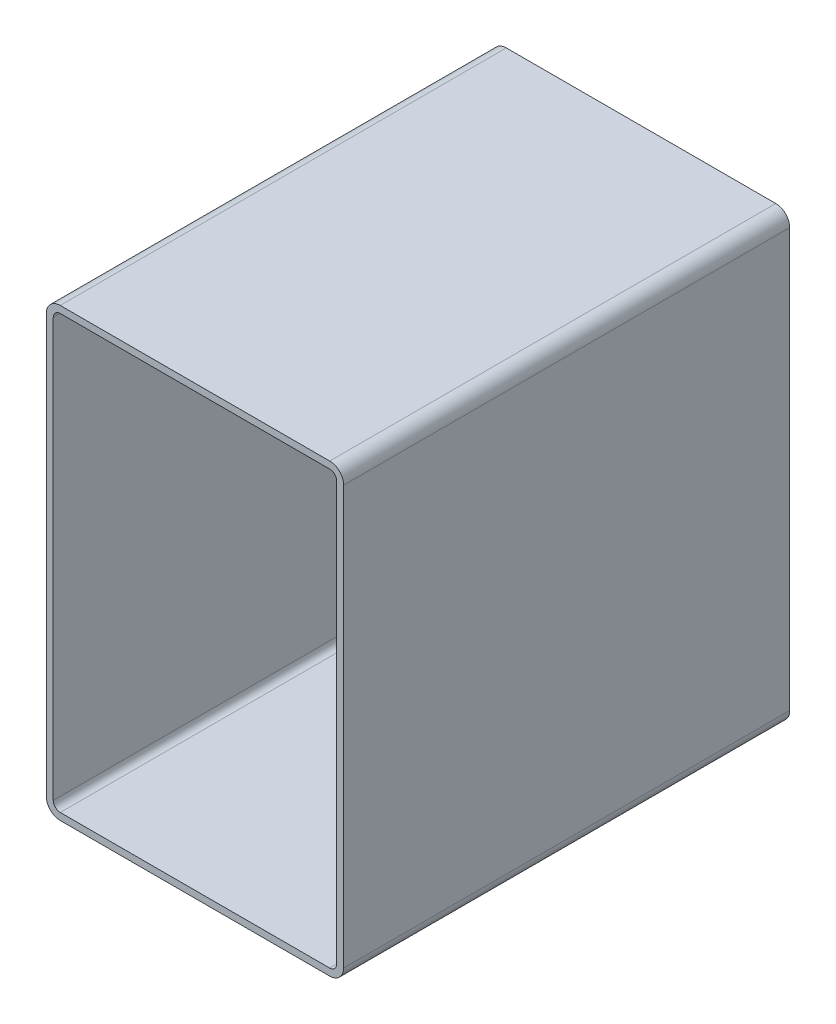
ISO-10303-21;
HEADER;
FILE_DESCRIPTION(('STEP AP214'),'2;1');
FILE_NAME('part.step','',(''),(''),'','','');
FILE_SCHEMA(('AUTOMOTIVE_DESIGN { 1 0 10303 214 1 1 1 1 }'));
ENDSEC;
DATA;
#1=APPLICATION_CONTEXT('core data for automotive mechanical design processes');
#2=APPLICATION_PROTOCOL_DEFINITION('international standard','automotive_design',2000,#1);
#3=PRODUCT_CONTEXT('',#1,'mechanical');
#4=PRODUCT('Part','Part','',(#3));
#5=PRODUCT_RELATED_PRODUCT_CATEGORY('part','',(#4));
#6=PRODUCT_DEFINITION_FORMATION('','',#4);
#7=PRODUCT_DEFINITION_CONTEXT('part definition',#1,'design');
#8=PRODUCT_DEFINITION('design','',#6,#7);
#9=PRODUCT_DEFINITION_SHAPE('','',#8);
#10=(LENGTH_UNIT() NAMED_UNIT(*) SI_UNIT(.MILLI.,.METRE.));
#11=(NAMED_UNIT(*) PLANE_ANGLE_UNIT() SI_UNIT($,.RADIAN.));
#12=(NAMED_UNIT(*) SI_UNIT($,.STERADIAN.) SOLID_ANGLE_UNIT());
#13=UNCERTAINTY_MEASURE_WITH_UNIT(LENGTH_MEASURE(1.E-05),#10,'distance_accuracy_value','');
#14=(GEOMETRIC_REPRESENTATION_CONTEXT(3) GLOBAL_UNCERTAINTY_ASSIGNED_CONTEXT((#13)) GLOBAL_UNIT_ASSIGNED_CONTEXT((#10,
#11,#12)) REPRESENTATION_CONTEXT('',''));
#15=CARTESIAN_POINT('',(0.,0.,0.));
#16=DIRECTION('',(0.,0.,1.));
#17=DIRECTION('',(1.,0.,0.));
#18=AXIS2_PLACEMENT_3D('',#15,#16,#17);
#19=CARTESIAN_POINT('',(10.9159404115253,297.149496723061,304.8));
#20=DIRECTION('',(0.,0.,1.));
#21=DIRECTION('',(1.,0.,0.));
#22=AXIS2_PLACEMENT_3D('',#19,#20,#21);
#23=PLANE('',#22);
#24=CARTESIAN_POINT('',(10.9159404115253,297.149496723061,304.8));
#25=DIRECTION('',(0.,0.,1.));
#26=DIRECTION('',(1.,0.,0.));
#27=AXIS2_PLACEMENT_3D('',#24,#25,#26);
#28=CIRCLE('',#27,9.52500000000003);
#29=CARTESIAN_POINT('',(10.9159404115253,306.674496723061,304.8));
#30=VERTEX_POINT('',#29);
#31=CARTESIAN_POINT('',(1.3909404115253,297.149496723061,304.8));
#32=VERTEX_POINT('',#31);
#33=EDGE_CURVE('E211',#30,#32,#28,.T.);
#34=ORIENTED_EDGE('',*,*,#33,.T.);
#35=DIRECTION('',(0.,-1.,0.));
#36=VECTOR('',#35,1.);
#37=CARTESIAN_POINT('',(1.3909404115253,11.3994967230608,304.8));
#38=LINE('',#37,#36);
#39=CARTESIAN_POINT('',(1.3909404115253,11.3994967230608,304.8));
#40=VERTEX_POINT('',#39);
#41=EDGE_CURVE('E214',#32,#40,#38,.T.);
#42=ORIENTED_EDGE('',*,*,#41,.T.);
#43=CARTESIAN_POINT('',(10.9159404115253,11.3994967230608,304.8));
#44=DIRECTION('',(0.,0.,1.));
#45=DIRECTION('',(1.,0.,0.));
#46=AXIS2_PLACEMENT_3D('',#43,#44,#45);
#47=CIRCLE('',#46,9.52499999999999);
#48=CARTESIAN_POINT('',(10.9159404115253,1.87449672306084,304.8));
#49=VERTEX_POINT('',#48);
#50=EDGE_CURVE('E217',#40,#49,#47,.T.);
#51=ORIENTED_EDGE('',*,*,#50,.T.);
#52=DIRECTION('',(1.,0.,0.));
#53=VECTOR('',#52,1.);
#54=CARTESIAN_POINT('',(195.065940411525,1.87449672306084,304.8));
#55=LINE('',#54,#53);
#56=CARTESIAN_POINT('',(195.065940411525,1.87449672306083,304.8));
#57=VERTEX_POINT('',#56);
#58=EDGE_CURVE('E219',#49,#57,#55,.T.);
#59=ORIENTED_EDGE('',*,*,#58,.T.);
#60=CARTESIAN_POINT('',(195.065940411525,11.3994967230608,304.8));
#61=DIRECTION('',(0.,0.,1.));
#62=DIRECTION('',(1.,0.,0.));
#63=AXIS2_PLACEMENT_3D('',#60,#61,#62);
#64=CIRCLE('',#63,9.525);
#65=CARTESIAN_POINT('',(204.590940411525,11.3994967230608,304.8));
#66=VERTEX_POINT('',#65);
#67=EDGE_CURVE('E221',#57,#66,#64,.T.);
#68=ORIENTED_EDGE('',*,*,#67,.T.);
#69=DIRECTION('',(0.,1.,0.));
#70=VECTOR('',#69,1.);
#71=CARTESIAN_POINT('',(204.590940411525,297.149496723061,304.8));
#72=LINE('',#71,#70);
#73=CARTESIAN_POINT('',(204.590940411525,297.149496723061,304.8));
#74=VERTEX_POINT('',#73);
#75=EDGE_CURVE('E223',#66,#74,#72,.T.);
#76=ORIENTED_EDGE('',*,*,#75,.T.);
#77=CARTESIAN_POINT('',(195.065940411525,297.149496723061,304.8));
#78=DIRECTION('',(0.,0.,1.));
#79=DIRECTION('',(1.,0.,0.));
#80=AXIS2_PLACEMENT_3D('',#77,#78,#79);
#81=CIRCLE('',#80,9.52500000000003);
#82=CARTESIAN_POINT('',(195.065940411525,306.674496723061,304.8));
#83=VERTEX_POINT('',#82);
#84=EDGE_CURVE('E225',#74,#83,#81,.T.);
#85=ORIENTED_EDGE('',*,*,#84,.T.);
#86=DIRECTION('',(-1.,0.,0.));
#87=VECTOR('',#86,1.);
#88=CARTESIAN_POINT('',(10.9159404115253,306.674496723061,304.8));
#89=LINE('',#88,#87);
#90=EDGE_CURVE('E227',#83,#30,#89,.T.);
#91=ORIENTED_EDGE('',*,*,#90,.T.);
#92=EDGE_LOOP('',(#34,#42,#51,#59,#68,#76,#85,#91));
#93=FACE_BOUND('',#92,.T.);
#94=DIRECTION('',(0.,-1.,0.));
#95=VECTOR('',#94,1.);
#96=CARTESIAN_POINT('',(6.1534404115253,11.3994967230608,304.8));
#97=LINE('',#96,#95);
#98=CARTESIAN_POINT('',(6.1534404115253,297.149496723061,304.8));
#99=VERTEX_POINT('',#98);
#100=CARTESIAN_POINT('',(6.1534404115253,11.3994967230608,304.8));
#101=VERTEX_POINT('',#100);
#102=EDGE_CURVE('E154',#99,#101,#97,.T.);
#103=ORIENTED_EDGE('',*,*,#102,.F.);
#104=CARTESIAN_POINT('',(10.9159404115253,297.149496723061,304.8));
#105=DIRECTION('',(0.,0.,1.));
#106=DIRECTION('',(1.,0.,0.));
#107=AXIS2_PLACEMENT_3D('',#104,#105,#106);
#108=CIRCLE('',#107,4.7625);
#109=CARTESIAN_POINT('',(10.9159404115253,301.911996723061,304.8));
#110=VERTEX_POINT('',#109);
#111=EDGE_CURVE('E146',#110,#99,#108,.T.);
#112=ORIENTED_EDGE('',*,*,#111,.F.);
#113=DIRECTION('',(-1.,0.,0.));
#114=VECTOR('',#113,1.);
#115=CARTESIAN_POINT('',(10.9159404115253,301.911996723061,304.8));
#116=LINE('',#115,#114);
#117=CARTESIAN_POINT('',(195.065940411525,301.911996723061,304.8));
#118=VERTEX_POINT('',#117);
#119=EDGE_CURVE('E179',#118,#110,#116,.T.);
#120=ORIENTED_EDGE('',*,*,#119,.F.);
#121=CARTESIAN_POINT('',(195.065940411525,297.149496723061,304.8));
#122=DIRECTION('',(0.,0.,1.));
#123=DIRECTION('',(1.,0.,0.));
#124=AXIS2_PLACEMENT_3D('',#121,#122,#123);
#125=CIRCLE('',#124,4.7625);
#126=CARTESIAN_POINT('',(199.828440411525,297.149496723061,304.8));
#127=VERTEX_POINT('',#126);
#128=EDGE_CURVE('E177',#127,#118,#125,.T.);
#129=ORIENTED_EDGE('',*,*,#128,.F.);
#130=DIRECTION('',(0.,1.,0.));
#131=VECTOR('',#130,1.);
#132=CARTESIAN_POINT('',(199.828440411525,297.149496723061,304.8));
#133=LINE('',#132,#131);
#134=CARTESIAN_POINT('',(199.828440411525,11.3994967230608,304.8));
#135=VERTEX_POINT('',#134);
#136=EDGE_CURVE('E175',#135,#127,#133,.T.);
#137=ORIENTED_EDGE('',*,*,#136,.F.);
#138=CARTESIAN_POINT('',(195.065940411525,11.3994967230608,304.8));
#139=DIRECTION('',(0.,0.,1.));
#140=DIRECTION('',(1.,0.,0.));
#141=AXIS2_PLACEMENT_3D('',#138,#139,#140);
#142=CIRCLE('',#141,4.76249999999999);
#143=CARTESIAN_POINT('',(195.065940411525,6.63699672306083,304.8));
#144=VERTEX_POINT('',#143);
#145=EDGE_CURVE('E173',#144,#135,#142,.T.);
#146=ORIENTED_EDGE('',*,*,#145,.F.);
#147=DIRECTION('',(1.,0.,0.));
#148=VECTOR('',#147,1.);
#149=CARTESIAN_POINT('',(195.065940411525,6.63699672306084,304.8));
#150=LINE('',#149,#148);
#151=CARTESIAN_POINT('',(10.9159404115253,6.63699672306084,304.8));
#152=VERTEX_POINT('',#151);
#153=EDGE_CURVE('E169',#152,#144,#150,.T.);
#154=ORIENTED_EDGE('',*,*,#153,.F.);
#155=CARTESIAN_POINT('',(10.9159404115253,11.3994967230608,304.8));
#156=DIRECTION('',(0.,0.,1.));
#157=DIRECTION('',(1.,0.,0.));
#158=AXIS2_PLACEMENT_3D('',#155,#156,#157);
#159=CIRCLE('',#158,4.76249999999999);
#160=EDGE_CURVE('E167',#101,#152,#159,.T.);
#161=ORIENTED_EDGE('',*,*,#160,.F.);
#162=EDGE_LOOP('',(#103,#112,#120,#129,#137,#146,#154,#161));
#163=FACE_BOUND('',#162,.T.);
#164=ADVANCED_FACE('F33',(#93,#163),#23,.T.);
#165=CARTESIAN_POINT('',(10.9159404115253,297.149496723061,0.));
#166=DIRECTION('',(0.,0.,1.));
#167=DIRECTION('',(1.,0.,0.));
#168=AXIS2_PLACEMENT_3D('',#165,#166,#167);
#169=PLANE('',#168);
#170=CARTESIAN_POINT('',(10.9159404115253,297.149496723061,0.));
#171=DIRECTION('',(0.,0.,1.));
#172=DIRECTION('',(1.,0.,0.));
#173=AXIS2_PLACEMENT_3D('',#170,#171,#172);
#174=CIRCLE('',#173,9.52500000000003);
#175=CARTESIAN_POINT('',(10.9159404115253,306.674496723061,0.));
#176=VERTEX_POINT('',#175);
#177=CARTESIAN_POINT('',(1.3909404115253,297.149496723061,0.));
#178=VERTEX_POINT('',#177);
#179=EDGE_CURVE('E162',#176,#178,#174,.T.);
#180=ORIENTED_EDGE('',*,*,#179,.F.);
#181=DIRECTION('',(-1.,0.,0.));
#182=VECTOR('',#181,1.);
#183=CARTESIAN_POINT('',(10.9159404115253,306.674496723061,0.));
#184=LINE('',#183,#182);
#185=CARTESIAN_POINT('',(195.065940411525,306.674496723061,0.));
#186=VERTEX_POINT('',#185);
#187=EDGE_CURVE('E215',#186,#176,#184,.T.);
#188=ORIENTED_EDGE('',*,*,#187,.F.);
#189=CARTESIAN_POINT('',(195.065940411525,297.149496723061,0.));
#190=DIRECTION('',(0.,0.,1.));
#191=DIRECTION('',(1.,0.,0.));
#192=AXIS2_PLACEMENT_3D('',#189,#190,#191);
#193=CIRCLE('',#192,9.52500000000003);
#194=CARTESIAN_POINT('',(204.590940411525,297.149496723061,0.));
#195=VERTEX_POINT('',#194);
#196=EDGE_CURVE('E242',#195,#186,#193,.T.);
#197=ORIENTED_EDGE('',*,*,#196,.F.);
#198=DIRECTION('',(0.,1.,0.));
#199=VECTOR('',#198,1.);
#200=CARTESIAN_POINT('',(204.590940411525,297.149496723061,0.));
#201=LINE('',#200,#199);
#202=CARTESIAN_POINT('',(204.590940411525,11.3994967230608,0.));
#203=VERTEX_POINT('',#202);
#204=EDGE_CURVE('E240',#203,#195,#201,.T.);
#205=ORIENTED_EDGE('',*,*,#204,.F.);
#206=CARTESIAN_POINT('',(195.065940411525,11.3994967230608,0.));
#207=DIRECTION('',(0.,0.,1.));
#208=DIRECTION('',(1.,0.,0.));
#209=AXIS2_PLACEMENT_3D('',#206,#207,#208);
#210=CIRCLE('',#209,9.525);
#211=CARTESIAN_POINT('',(195.065940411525,1.87449672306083,0.));
#212=VERTEX_POINT('',#211);
#213=EDGE_CURVE('E238',#212,#203,#210,.T.);
#214=ORIENTED_EDGE('',*,*,#213,.F.);
#215=DIRECTION('',(1.,0.,0.));
#216=VECTOR('',#215,1.);
#217=CARTESIAN_POINT('',(195.065940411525,1.87449672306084,0.));
#218=LINE('',#217,#216);
#219=CARTESIAN_POINT('',(10.9159404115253,1.87449672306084,0.));
#220=VERTEX_POINT('',#219);
#221=EDGE_CURVE('E236',#220,#212,#218,.T.);
#222=ORIENTED_EDGE('',*,*,#221,.F.);
#223=CARTESIAN_POINT('',(10.9159404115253,11.3994967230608,0.));
#224=DIRECTION('',(0.,0.,1.));
#225=DIRECTION('',(1.,0.,0.));
#226=AXIS2_PLACEMENT_3D('',#223,#224,#225);
#227=CIRCLE('',#226,9.52499999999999);
#228=CARTESIAN_POINT('',(1.3909404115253,11.3994967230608,0.));
#229=VERTEX_POINT('',#228);
#230=EDGE_CURVE('E234',#229,#220,#227,.T.);
#231=ORIENTED_EDGE('',*,*,#230,.F.);
#232=DIRECTION('',(0.,-1.,0.));
#233=VECTOR('',#232,1.);
#234=CARTESIAN_POINT('',(1.3909404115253,11.3994967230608,0.));
#235=LINE('',#234,#233);
#236=EDGE_CURVE('E232',#178,#229,#235,.T.);
#237=ORIENTED_EDGE('',*,*,#236,.F.);
#238=EDGE_LOOP('',(#180,#188,#197,#205,#214,#222,#231,#237));
#239=FACE_BOUND('',#238,.T.);
#240=CARTESIAN_POINT('',(10.9159404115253,297.149496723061,0.));
#241=DIRECTION('',(0.,0.,1.));
#242=DIRECTION('',(1.,0.,0.));
#243=AXIS2_PLACEMENT_3D('',#240,#241,#242);
#244=CIRCLE('',#243,4.7625);
#245=CARTESIAN_POINT('',(10.9159404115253,301.911996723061,0.));
#246=VERTEX_POINT('',#245);
#247=CARTESIAN_POINT('',(6.1534404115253,297.149496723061,0.));
#248=VERTEX_POINT('',#247);
#249=EDGE_CURVE('E56',#246,#248,#244,.T.);
#250=ORIENTED_EDGE('',*,*,#249,.T.);
#251=DIRECTION('',(0.,-1.,0.));
#252=VECTOR('',#251,1.);
#253=CARTESIAN_POINT('',(6.1534404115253,11.3994967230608,0.));
#254=LINE('',#253,#252);
#255=CARTESIAN_POINT('',(6.1534404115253,11.3994967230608,0.));
#256=VERTEX_POINT('',#255);
#257=EDGE_CURVE('E161',#248,#256,#254,.T.);
#258=ORIENTED_EDGE('',*,*,#257,.T.);
#259=CARTESIAN_POINT('',(10.9159404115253,11.3994967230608,0.));
#260=DIRECTION('',(0.,0.,1.));
#261=DIRECTION('',(1.,0.,0.));
#262=AXIS2_PLACEMENT_3D('',#259,#260,#261);
#263=CIRCLE('',#262,4.76249999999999);
#264=CARTESIAN_POINT('',(10.9159404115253,6.63699672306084,0.));
#265=VERTEX_POINT('',#264);
#266=EDGE_CURVE('E183',#256,#265,#263,.T.);
#267=ORIENTED_EDGE('',*,*,#266,.T.);
#268=DIRECTION('',(1.,0.,0.));
#269=VECTOR('',#268,1.);
#270=CARTESIAN_POINT('',(195.065940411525,6.63699672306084,0.));
#271=LINE('',#270,#269);
#272=CARTESIAN_POINT('',(195.065940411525,6.63699672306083,0.));
#273=VERTEX_POINT('',#272);
#274=EDGE_CURVE('E186',#265,#273,#271,.T.);
#275=ORIENTED_EDGE('',*,*,#274,.T.);
#276=CARTESIAN_POINT('',(195.065940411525,11.3994967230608,0.));
#277=DIRECTION('',(0.,0.,1.));
#278=DIRECTION('',(1.,0.,0.));
#279=AXIS2_PLACEMENT_3D('',#276,#277,#278);
#280=CIRCLE('',#279,4.76249999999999);
#281=CARTESIAN_POINT('',(199.828440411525,11.3994967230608,0.));
#282=VERTEX_POINT('',#281);
#283=EDGE_CURVE('E189',#273,#282,#280,.T.);
#284=ORIENTED_EDGE('',*,*,#283,.T.);
#285=DIRECTION('',(0.,1.,0.));
#286=VECTOR('',#285,1.);
#287=CARTESIAN_POINT('',(199.828440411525,297.149496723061,0.));
#288=LINE('',#287,#286);
#289=CARTESIAN_POINT('',(199.828440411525,297.149496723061,0.));
#290=VERTEX_POINT('',#289);
#291=EDGE_CURVE('E192',#282,#290,#288,.T.);
#292=ORIENTED_EDGE('',*,*,#291,.T.);
#293=CARTESIAN_POINT('',(195.065940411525,297.149496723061,0.));
#294=DIRECTION('',(0.,0.,1.));
#295=DIRECTION('',(1.,0.,0.));
#296=AXIS2_PLACEMENT_3D('',#293,#294,#295);
#297=CIRCLE('',#296,4.7625);
#298=CARTESIAN_POINT('',(195.065940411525,301.911996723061,0.));
#299=VERTEX_POINT('',#298);
#300=EDGE_CURVE('E195',#290,#299,#297,.T.);
#301=ORIENTED_EDGE('',*,*,#300,.T.);
#302=DIRECTION('',(-1.,0.,0.));
#303=VECTOR('',#302,1.);
#304=CARTESIAN_POINT('',(10.9159404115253,301.911996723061,0.));
#305=LINE('',#304,#303);
#306=EDGE_CURVE('E155',#299,#246,#305,.T.);
#307=ORIENTED_EDGE('',*,*,#306,.T.);
#308=EDGE_LOOP('',(#250,#258,#267,#275,#284,#292,#301,#307));
#309=FACE_BOUND('',#308,.T.);
#310=ADVANCED_FACE('F272',(#239,#309),#169,.F.);
#311=CARTESIAN_POINT('',(10.9159404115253,297.149496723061,304.8));
#312=DIRECTION('',(0.,0.,-1.));
#313=DIRECTION('',(-1.,0.,0.));
#314=AXIS2_PLACEMENT_3D('',#311,#312,#313);
#315=CYLINDRICAL_SURFACE('',#314,9.52500000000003);
#316=ORIENTED_EDGE('',*,*,#179,.T.);
#317=DIRECTION('',(0.,0.,-1.));
#318=VECTOR('',#317,1.);
#319=CARTESIAN_POINT('',(1.3909404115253,297.149496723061,304.8));
#320=LINE('',#319,#318);
#321=EDGE_CURVE('E11',#32,#178,#320,.T.);
#322=ORIENTED_EDGE('',*,*,#321,.F.);
#323=ORIENTED_EDGE('',*,*,#33,.F.);
#324=DIRECTION('',(0.,0.,-1.));
#325=VECTOR('',#324,1.);
#326=CARTESIAN_POINT('',(10.9159404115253,306.674496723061,304.8));
#327=LINE('',#326,#325);
#328=EDGE_CURVE('E229',#30,#176,#327,.T.);
#329=ORIENTED_EDGE('',*,*,#328,.T.);
#330=EDGE_LOOP('',(#316,#322,#323,#329));
#331=FACE_BOUND('',#330,.T.);
#332=ADVANCED_FACE('F35',(#331),#315,.T.);
#333=CARTESIAN_POINT('',(1.3909404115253,11.3994967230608,304.8));
#334=DIRECTION('',(1.,0.,0.));
#335=DIRECTION('',(0.,0.,-1.));
#336=AXIS2_PLACEMENT_3D('',#333,#334,#335);
#337=PLANE('',#336);
#338=ORIENTED_EDGE('',*,*,#236,.T.);
#339=DIRECTION('',(0.,0.,-1.));
#340=VECTOR('',#339,1.);
#341=CARTESIAN_POINT('',(1.3909404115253,11.3994967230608,304.8));
#342=LINE('',#341,#340);
#343=EDGE_CURVE('E41',#40,#229,#342,.T.);
#344=ORIENTED_EDGE('',*,*,#343,.F.);
#345=ORIENTED_EDGE('',*,*,#41,.F.);
#346=ORIENTED_EDGE('',*,*,#321,.T.);
#347=EDGE_LOOP('',(#338,#344,#345,#346));
#348=FACE_BOUND('',#347,.T.);
#349=ADVANCED_FACE('F289',(#348),#337,.F.);
#350=CARTESIAN_POINT('',(10.9159404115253,11.3994967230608,304.8));
#351=DIRECTION('',(0.,0.,-1.));
#352=DIRECTION('',(-1.,0.,0.));
#353=AXIS2_PLACEMENT_3D('',#350,#351,#352);
#354=CYLINDRICAL_SURFACE('',#353,9.52499999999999);
#355=ORIENTED_EDGE('',*,*,#230,.T.);
#356=DIRECTION('',(0.,0.,-1.));
#357=VECTOR('',#356,1.);
#358=CARTESIAN_POINT('',(10.9159404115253,1.87449672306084,304.8));
#359=LINE('',#358,#357);
#360=EDGE_CURVE('E259',#49,#220,#359,.T.);
#361=ORIENTED_EDGE('',*,*,#360,.F.);
#362=ORIENTED_EDGE('',*,*,#50,.F.);
#363=ORIENTED_EDGE('',*,*,#343,.T.);
#364=EDGE_LOOP('',(#355,#361,#362,#363));
#365=FACE_BOUND('',#364,.T.);
#366=ADVANCED_FACE('F266',(#365),#354,.T.);
#367=CARTESIAN_POINT('',(195.065940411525,1.87449672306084,304.8));
#368=DIRECTION('',(0.,1.,0.));
#369=DIRECTION('',(0.,0.,1.));
#370=AXIS2_PLACEMENT_3D('',#367,#368,#369);
#371=PLANE('',#370);
#372=ORIENTED_EDGE('',*,*,#221,.T.);
#373=DIRECTION('',(0.,0.,-1.));
#374=VECTOR('',#373,1.);
#375=CARTESIAN_POINT('',(195.065940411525,1.87449672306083,304.8));
#376=LINE('',#375,#374);
#377=EDGE_CURVE('E256',#57,#212,#376,.T.);
#378=ORIENTED_EDGE('',*,*,#377,.F.);
#379=ORIENTED_EDGE('',*,*,#58,.F.);
#380=ORIENTED_EDGE('',*,*,#360,.T.);
#381=EDGE_LOOP('',(#372,#378,#379,#380));
#382=FACE_BOUND('',#381,.T.);
#383=ADVANCED_FACE('F278',(#382),#371,.F.);
#384=CARTESIAN_POINT('',(195.065940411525,11.3994967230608,304.8));
#385=DIRECTION('',(0.,0.,-1.));
#386=DIRECTION('',(-1.,0.,0.));
#387=AXIS2_PLACEMENT_3D('',#384,#385,#386);
#388=CYLINDRICAL_SURFACE('',#387,9.525);
#389=ORIENTED_EDGE('',*,*,#213,.T.);
#390=DIRECTION('',(0.,0.,-1.));
#391=VECTOR('',#390,1.);
#392=CARTESIAN_POINT('',(204.590940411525,11.3994967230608,304.8));
#393=LINE('',#392,#391);
#394=EDGE_CURVE('E253',#66,#203,#393,.T.);
#395=ORIENTED_EDGE('',*,*,#394,.F.);
#396=ORIENTED_EDGE('',*,*,#67,.F.);
#397=ORIENTED_EDGE('',*,*,#377,.T.);
#398=EDGE_LOOP('',(#389,#395,#396,#397));
#399=FACE_BOUND('',#398,.T.);
#400=ADVANCED_FACE('F282',(#399),#388,.T.);
#401=CARTESIAN_POINT('',(204.590940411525,297.149496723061,304.8));
#402=DIRECTION('',(-1.,0.,0.));
#403=DIRECTION('',(0.,0.,1.));
#404=AXIS2_PLACEMENT_3D('',#401,#402,#403);
#405=PLANE('',#404);
#406=ORIENTED_EDGE('',*,*,#204,.T.);
#407=DIRECTION('',(0.,0.,-1.));
#408=VECTOR('',#407,1.);
#409=CARTESIAN_POINT('',(204.590940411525,297.149496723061,304.8));
#410=LINE('',#409,#408);
#411=EDGE_CURVE('E250',#74,#195,#410,.T.);
#412=ORIENTED_EDGE('',*,*,#411,.F.);
#413=ORIENTED_EDGE('',*,*,#75,.F.);
#414=ORIENTED_EDGE('',*,*,#394,.T.);
#415=EDGE_LOOP('',(#406,#412,#413,#414));
#416=FACE_BOUND('',#415,.T.);
#417=ADVANCED_FACE('F302',(#416),#405,.F.);
#418=CARTESIAN_POINT('',(195.065940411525,297.149496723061,304.8));
#419=DIRECTION('',(0.,0.,-1.));
#420=DIRECTION('',(-1.,0.,0.));
#421=AXIS2_PLACEMENT_3D('',#418,#419,#420);
#422=CYLINDRICAL_SURFACE('',#421,9.52500000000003);
#423=ORIENTED_EDGE('',*,*,#196,.T.);
#424=DIRECTION('',(0.,0.,-1.));
#425=VECTOR('',#424,1.);
#426=CARTESIAN_POINT('',(195.065940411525,306.674496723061,304.8));
#427=LINE('',#426,#425);
#428=EDGE_CURVE('E247',#83,#186,#427,.T.);
#429=ORIENTED_EDGE('',*,*,#428,.F.);
#430=ORIENTED_EDGE('',*,*,#84,.F.);
#431=ORIENTED_EDGE('',*,*,#411,.T.);
#432=EDGE_LOOP('',(#423,#429,#430,#431));
#433=FACE_BOUND('',#432,.T.);
#434=ADVANCED_FACE('F300',(#433),#422,.T.);
#435=CARTESIAN_POINT('',(10.9159404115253,306.674496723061,304.8));
#436=DIRECTION('',(0.,-1.,0.));
#437=DIRECTION('',(0.,0.,-1.));
#438=AXIS2_PLACEMENT_3D('',#435,#436,#437);
#439=PLANE('',#438);
#440=ORIENTED_EDGE('',*,*,#187,.T.);
#441=ORIENTED_EDGE('',*,*,#328,.F.);
#442=ORIENTED_EDGE('',*,*,#90,.F.);
#443=ORIENTED_EDGE('',*,*,#428,.T.);
#444=EDGE_LOOP('',(#440,#441,#442,#443));
#445=FACE_BOUND('',#444,.T.);
#446=ADVANCED_FACE('F295',(#445),#439,.F.);
#447=CARTESIAN_POINT('',(10.9159404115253,297.149496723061,304.8));
#448=DIRECTION('',(0.,0.,-1.));
#449=DIRECTION('',(-1.,0.,0.));
#450=AXIS2_PLACEMENT_3D('',#447,#448,#449);
#451=CYLINDRICAL_SURFACE('',#450,4.7625);
#452=ORIENTED_EDGE('',*,*,#249,.F.);
#453=DIRECTION('',(0.,0.,-1.));
#454=VECTOR('',#453,1.);
#455=CARTESIAN_POINT('',(10.9159404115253,301.911996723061,304.8));
#456=LINE('',#455,#454);
#457=EDGE_CURVE('E150',#110,#246,#456,.T.);
#458=ORIENTED_EDGE('',*,*,#457,.F.);
#459=ORIENTED_EDGE('',*,*,#111,.T.);
#460=DIRECTION('',(0.,0.,-1.));
#461=VECTOR('',#460,1.);
#462=CARTESIAN_POINT('',(6.1534404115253,297.149496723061,304.8));
#463=LINE('',#462,#461);
#464=EDGE_CURVE('E149',#99,#248,#463,.T.);
#465=ORIENTED_EDGE('',*,*,#464,.T.);
#466=EDGE_LOOP('',(#452,#458,#459,#465));
#467=FACE_BOUND('',#466,.T.);
#468=ADVANCED_FACE('F148',(#467),#451,.F.);
#469=CARTESIAN_POINT('',(6.1534404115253,11.3994967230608,304.8));
#470=DIRECTION('',(1.,0.,0.));
#471=DIRECTION('',(0.,0.,-1.));
#472=AXIS2_PLACEMENT_3D('',#469,#470,#471);
#473=PLANE('',#472);
#474=ORIENTED_EDGE('',*,*,#257,.F.);
#475=ORIENTED_EDGE('',*,*,#464,.F.);
#476=ORIENTED_EDGE('',*,*,#102,.T.);
#477=DIRECTION('',(0.,0.,-1.));
#478=VECTOR('',#477,1.);
#479=CARTESIAN_POINT('',(6.1534404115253,11.3994967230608,304.8));
#480=LINE('',#479,#478);
#481=EDGE_CURVE('E163',#101,#256,#480,.T.);
#482=ORIENTED_EDGE('',*,*,#481,.T.);
#483=EDGE_LOOP('',(#474,#475,#476,#482));
#484=FACE_BOUND('',#483,.T.);
#485=ADVANCED_FACE('F158',(#484),#473,.T.);
#486=CARTESIAN_POINT('',(10.9159404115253,11.3994967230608,304.8));
#487=DIRECTION('',(0.,0.,-1.));
#488=DIRECTION('',(-1.,0.,0.));
#489=AXIS2_PLACEMENT_3D('',#486,#487,#488);
#490=CYLINDRICAL_SURFACE('',#489,4.76249999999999);
#491=ORIENTED_EDGE('',*,*,#266,.F.);
#492=ORIENTED_EDGE('',*,*,#481,.F.);
#493=ORIENTED_EDGE('',*,*,#160,.T.);
#494=DIRECTION('',(0.,0.,-1.));
#495=VECTOR('',#494,1.);
#496=CARTESIAN_POINT('',(10.9159404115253,6.63699672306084,304.8));
#497=LINE('',#496,#495);
#498=EDGE_CURVE('E208',#152,#265,#497,.T.);
#499=ORIENTED_EDGE('',*,*,#498,.T.);
#500=EDGE_LOOP('',(#491,#492,#493,#499));
#501=FACE_BOUND('',#500,.T.);
#502=ADVANCED_FACE('F327',(#501),#490,.F.);
#503=CARTESIAN_POINT('',(195.065940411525,6.63699672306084,304.8));
#504=DIRECTION('',(0.,1.,0.));
#505=DIRECTION('',(0.,0.,1.));
#506=AXIS2_PLACEMENT_3D('',#503,#504,#505);
#507=PLANE('',#506);
#508=ORIENTED_EDGE('',*,*,#274,.F.);
#509=ORIENTED_EDGE('',*,*,#498,.F.);
#510=ORIENTED_EDGE('',*,*,#153,.T.);
#511=DIRECTION('',(0.,0.,-1.));
#512=VECTOR('',#511,1.);
#513=CARTESIAN_POINT('',(195.065940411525,6.63699672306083,304.8));
#514=LINE('',#513,#512);
#515=EDGE_CURVE('E206',#144,#273,#514,.T.);
#516=ORIENTED_EDGE('',*,*,#515,.T.);
#517=EDGE_LOOP('',(#508,#509,#510,#516));
#518=FACE_BOUND('',#517,.T.);
#519=ADVANCED_FACE('F331',(#518),#507,.T.);
#520=CARTESIAN_POINT('',(195.065940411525,11.3994967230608,304.8));
#521=DIRECTION('',(0.,0.,-1.));
#522=DIRECTION('',(-1.,0.,0.));
#523=AXIS2_PLACEMENT_3D('',#520,#521,#522);
#524=CYLINDRICAL_SURFACE('',#523,4.76249999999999);
#525=ORIENTED_EDGE('',*,*,#283,.F.);
#526=ORIENTED_EDGE('',*,*,#515,.F.);
#527=ORIENTED_EDGE('',*,*,#145,.T.);
#528=DIRECTION('',(0.,0.,-1.));
#529=VECTOR('',#528,1.);
#530=CARTESIAN_POINT('',(199.828440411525,11.3994967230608,304.8));
#531=LINE('',#530,#529);
#532=EDGE_CURVE('E204',#135,#282,#531,.T.);
#533=ORIENTED_EDGE('',*,*,#532,.T.);
#534=EDGE_LOOP('',(#525,#526,#527,#533));
#535=FACE_BOUND('',#534,.T.);
#536=ADVANCED_FACE('F337',(#535),#524,.F.);
#537=CARTESIAN_POINT('',(199.828440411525,297.149496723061,304.8));
#538=DIRECTION('',(-1.,0.,0.));
#539=DIRECTION('',(0.,0.,1.));
#540=AXIS2_PLACEMENT_3D('',#537,#538,#539);
#541=PLANE('',#540);
#542=ORIENTED_EDGE('',*,*,#291,.F.);
#543=ORIENTED_EDGE('',*,*,#532,.F.);
#544=ORIENTED_EDGE('',*,*,#136,.T.);
#545=DIRECTION('',(0.,0.,-1.));
#546=VECTOR('',#545,1.);
#547=CARTESIAN_POINT('',(199.828440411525,297.149496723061,304.8));
#548=LINE('',#547,#546);
#549=EDGE_CURVE('E202',#127,#290,#548,.T.);
#550=ORIENTED_EDGE('',*,*,#549,.T.);
#551=EDGE_LOOP('',(#542,#543,#544,#550));
#552=FACE_BOUND('',#551,.T.);
#553=ADVANCED_FACE('F341',(#552),#541,.T.);
#554=CARTESIAN_POINT('',(195.065940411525,297.149496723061,304.8));
#555=DIRECTION('',(0.,0.,-1.));
#556=DIRECTION('',(-1.,0.,0.));
#557=AXIS2_PLACEMENT_3D('',#554,#555,#556);
#558=CYLINDRICAL_SURFACE('',#557,4.7625);
#559=ORIENTED_EDGE('',*,*,#300,.F.);
#560=ORIENTED_EDGE('',*,*,#549,.F.);
#561=ORIENTED_EDGE('',*,*,#128,.T.);
#562=DIRECTION('',(0.,0.,-1.));
#563=VECTOR('',#562,1.);
#564=CARTESIAN_POINT('',(195.065940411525,301.911996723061,304.8));
#565=LINE('',#564,#563);
#566=EDGE_CURVE('E48',#118,#299,#565,.T.);
#567=ORIENTED_EDGE('',*,*,#566,.T.);
#568=EDGE_LOOP('',(#559,#560,#561,#567));
#569=FACE_BOUND('',#568,.T.);
#570=ADVANCED_FACE('F345',(#569),#558,.F.);
#571=CARTESIAN_POINT('',(10.9159404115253,301.911996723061,304.8));
#572=DIRECTION('',(0.,-1.,0.));
#573=DIRECTION('',(0.,0.,-1.));
#574=AXIS2_PLACEMENT_3D('',#571,#572,#573);
#575=PLANE('',#574);
#576=ORIENTED_EDGE('',*,*,#306,.F.);
#577=ORIENTED_EDGE('',*,*,#566,.F.);
#578=ORIENTED_EDGE('',*,*,#119,.T.);
#579=ORIENTED_EDGE('',*,*,#457,.T.);
#580=EDGE_LOOP('',(#576,#577,#578,#579));
#581=FACE_BOUND('',#580,.T.);
#582=ADVANCED_FACE('F349',(#581),#575,.T.);
#583=CLOSED_SHELL('',(#164,#310,#332,#349,#366,#383,#400,#417,#434,#446,#468,#485,#502,#519,
#536,#553,#570,#582));
#584=MANIFOLD_SOLID_BREP('B2',#583);
#585=ADVANCED_BREP_SHAPE_REPRESENTATION('',(#18,#584),#14);
#586=SHAPE_DEFINITION_REPRESENTATION(#9,#585);
ENDSEC;
END-ISO-10303-21;
